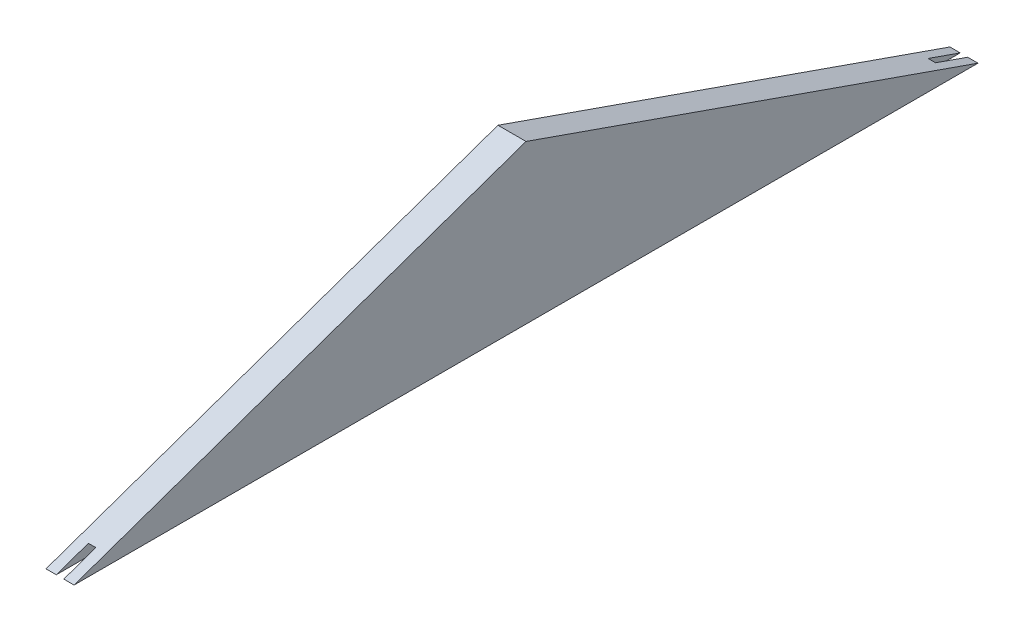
ISO-10303-21;
HEADER;
FILE_DESCRIPTION(('STEP AP214'),'2;1');
FILE_NAME('part.step','',(''),(''),'','','');
FILE_SCHEMA(('AUTOMOTIVE_DESIGN { 1 0 10303 214 1 1 1 1 }'));
ENDSEC;
DATA;
#1=APPLICATION_CONTEXT('core data for automotive mechanical design processes');
#2=APPLICATION_PROTOCOL_DEFINITION('international standard','automotive_design',2000,#1);
#3=PRODUCT_CONTEXT('',#1,'mechanical');
#4=PRODUCT('Part','Part','',(#3));
#5=PRODUCT_RELATED_PRODUCT_CATEGORY('part','',(#4));
#6=PRODUCT_DEFINITION_FORMATION('','',#4);
#7=PRODUCT_DEFINITION_CONTEXT('part definition',#1,'design');
#8=PRODUCT_DEFINITION('design','',#6,#7);
#9=PRODUCT_DEFINITION_SHAPE('','',#8);
#10=(LENGTH_UNIT() NAMED_UNIT(*) SI_UNIT(.MILLI.,.METRE.));
#11=(NAMED_UNIT(*) PLANE_ANGLE_UNIT() SI_UNIT($,.RADIAN.));
#12=(NAMED_UNIT(*) SI_UNIT($,.STERADIAN.) SOLID_ANGLE_UNIT());
#13=UNCERTAINTY_MEASURE_WITH_UNIT(LENGTH_MEASURE(1.E-05),#10,'distance_accuracy_value','');
#14=(GEOMETRIC_REPRESENTATION_CONTEXT(3) GLOBAL_UNCERTAINTY_ASSIGNED_CONTEXT((#13)) GLOBAL_UNIT_ASSIGNED_CONTEXT((#10,
#11,#12)) REPRESENTATION_CONTEXT('',''));
#15=CARTESIAN_POINT('',(0.,0.,0.));
#16=DIRECTION('',(0.,0.,1.));
#17=DIRECTION('',(1.,0.,0.));
#18=AXIS2_PLACEMENT_3D('',#15,#16,#17);
#19=CARTESIAN_POINT('',(-1.99999999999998,0.,482.9));
#20=DIRECTION('',(1.,0.,0.));
#21=DIRECTION('',(0.,1.,0.));
#22=AXIS2_PLACEMENT_3D('',#19,#20,#21);
#23=PLANE('',#22);
#24=DIRECTION('',(0.,0.330349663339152,-0.943858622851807));
#25=VECTOR('',#24,1.);
#26=CARTESIAN_POINT('',(-1.99999999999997,-38.7528058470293,469.336553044));
#27=LINE('',#26,#25);
#28=CARTESIAN_POINT('',(-1.99999999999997,-43.5,482.9));
#29=VERTEX_POINT('',#28);
#30=CARTESIAN_POINT('',(-1.99999999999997,-37.5,465.757098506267));
#31=VERTEX_POINT('',#30);
#32=EDGE_CURVE('E91',#29,#31,#27,.T.);
#33=ORIENTED_EDGE('',*,*,#32,.F.);
#34=DIRECTION('',(0.,0.,-1.));
#35=VECTOR('',#34,1.);
#36=CARTESIAN_POINT('',(-1.99999999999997,-43.5,482.9));
#37=LINE('',#36,#35);
#38=CARTESIAN_POINT('',(-1.99999999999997,-43.5,0.));
#39=VERTEX_POINT('',#38);
#40=EDGE_CURVE('E76',#29,#39,#37,.T.);
#41=ORIENTED_EDGE('',*,*,#40,.T.);
#42=DIRECTION('',(0.,0.330349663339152,0.943858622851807));
#43=VECTOR('',#42,1.);
#44=CARTESIAN_POINT('',(-1.99999999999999,111.817045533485,443.764135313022));
#45=LINE('',#44,#43);
#46=CARTESIAN_POINT('',(-1.99999999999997,-37.5,17.1429014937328));
#47=VERTEX_POINT('',#46);
#48=EDGE_CURVE('E83',#39,#47,#45,.T.);
#49=ORIENTED_EDGE('',*,*,#48,.T.);
#50=DIRECTION('',(0.,0.,-1.));
#51=VECTOR('',#50,1.);
#52=CARTESIAN_POINT('',(-1.99999999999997,-37.5,482.9));
#53=LINE('',#52,#51);
#54=EDGE_CURVE('E159',#31,#47,#53,.T.);
#55=ORIENTED_EDGE('',*,*,#54,.F.);
#56=EDGE_LOOP('',(#33,#41,#49,#55));
#57=FACE_BOUND('',#56,.T.);
#58=ADVANCED_FACE('F68',(#57),#23,.T.);
#59=CARTESIAN_POINT('',(0.,-37.5,482.9));
#60=DIRECTION('',(0.,1.,0.));
#61=DIRECTION('',(0.,0.,1.));
#62=AXIS2_PLACEMENT_3D('',#59,#60,#61);
#63=PLANE('',#62);
#64=DIRECTION('',(0.,0.,-1.));
#65=VECTOR('',#64,1.);
#66=CARTESIAN_POINT('',(2.,-37.5,482.9));
#67=LINE('',#66,#65);
#68=CARTESIAN_POINT('',(2.,-37.5,465.757098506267));
#69=VERTEX_POINT('',#68);
#70=CARTESIAN_POINT('',(2.,-37.5,17.1429014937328));
#71=VERTEX_POINT('',#70);
#72=EDGE_CURVE('E152',#69,#71,#67,.T.);
#73=ORIENTED_EDGE('',*,*,#72,.F.);
#74=DIRECTION('',(-1.,0.,0.));
#75=VECTOR('',#74,1.);
#76=CARTESIAN_POINT('',(0.,-37.5,465.757098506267));
#77=LINE('',#76,#75);
#78=EDGE_CURVE('E171',#69,#31,#77,.T.);
#79=ORIENTED_EDGE('',*,*,#78,.T.);
#80=ORIENTED_EDGE('',*,*,#54,.T.);
#81=DIRECTION('',(-1.,0.,0.));
#82=VECTOR('',#81,1.);
#83=CARTESIAN_POINT('',(0.,-37.5,17.1429014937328));
#84=LINE('',#83,#82);
#85=EDGE_CURVE('E185',#71,#47,#84,.T.);
#86=ORIENTED_EDGE('',*,*,#85,.F.);
#87=EDGE_LOOP('',(#73,#79,#80,#86));
#88=FACE_BOUND('',#87,.T.);
#89=ADVANCED_FACE('F193',(#88),#63,.F.);
#90=CARTESIAN_POINT('',(2.,0.,482.9));
#91=DIRECTION('',(1.,0.,0.));
#92=DIRECTION('',(0.,1.,0.));
#93=AXIS2_PLACEMENT_3D('',#90,#91,#92);
#94=PLANE('',#93);
#95=DIRECTION('',(0.,0.,-1.));
#96=VECTOR('',#95,1.);
#97=CARTESIAN_POINT('',(2.00000000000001,-43.5,482.9));
#98=LINE('',#97,#96);
#99=CARTESIAN_POINT('',(2.00000000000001,-43.5,482.9));
#100=VERTEX_POINT('',#99);
#101=CARTESIAN_POINT('',(2.00000000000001,-43.5,0.));
#102=VERTEX_POINT('',#101);
#103=EDGE_CURVE('E150',#100,#102,#98,.T.);
#104=ORIENTED_EDGE('',*,*,#103,.F.);
#105=DIRECTION('',(0.,0.330349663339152,-0.943858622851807));
#106=VECTOR('',#105,1.);
#107=CARTESIAN_POINT('',(2.,-38.7528058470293,469.336553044));
#108=LINE('',#107,#106);
#109=EDGE_CURVE('E132',#100,#69,#108,.T.);
#110=ORIENTED_EDGE('',*,*,#109,.T.);
#111=ORIENTED_EDGE('',*,*,#72,.T.);
#112=DIRECTION('',(0.,0.330349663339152,0.943858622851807));
#113=VECTOR('',#112,1.);
#114=CARTESIAN_POINT('',(1.99999999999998,111.817045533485,443.764135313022));
#115=LINE('',#114,#113);
#116=EDGE_CURVE('E183',#102,#71,#115,.T.);
#117=ORIENTED_EDGE('',*,*,#116,.F.);
#118=EDGE_LOOP('',(#104,#110,#111,#117));
#119=FACE_BOUND('',#118,.T.);
#120=ADVANCED_FACE('F189',(#119),#94,.F.);
#121=CARTESIAN_POINT('',(-7.5,0.,482.9));
#122=DIRECTION('',(1.,0.,0.));
#123=DIRECTION('',(0.,1.,0.));
#124=AXIS2_PLACEMENT_3D('',#121,#122,#123);
#125=PLANE('',#124);
#126=DIRECTION('',(0.,0.,-1.));
#127=VECTOR('',#126,1.);
#128=CARTESIAN_POINT('',(-7.49999999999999,-43.5,482.9));
#129=LINE('',#128,#127);
#130=CARTESIAN_POINT('',(-7.50000000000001,-43.5,482.9));
#131=VERTEX_POINT('',#130);
#132=CARTESIAN_POINT('',(-7.50000000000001,-43.5,0.));
#133=VERTEX_POINT('',#132);
#134=EDGE_CURVE('E12',#131,#133,#129,.T.);
#135=ORIENTED_EDGE('',*,*,#134,.F.);
#136=DIRECTION('',(0.,0.330349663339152,-0.943858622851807));
#137=VECTOR('',#136,1.);
#138=CARTESIAN_POINT('',(-7.50000000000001,-43.5,482.9));
#139=LINE('',#138,#137);
#140=CARTESIAN_POINT('',(-7.50000000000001,41.0072813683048,241.45));
#141=VERTEX_POINT('',#140);
#142=EDGE_CURVE('E145',#131,#141,#139,.T.);
#143=ORIENTED_EDGE('',*,*,#142,.T.);
#144=DIRECTION('',(0.,0.330349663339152,0.943858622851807));
#145=VECTOR('',#144,1.);
#146=CARTESIAN_POINT('',(-7.50000000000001,-43.5,0.));
#147=LINE('',#146,#145);
#148=EDGE_CURVE('E146',#133,#141,#147,.T.);
#149=ORIENTED_EDGE('',*,*,#148,.F.);
#150=EDGE_LOOP('',(#135,#143,#149));
#151=FACE_BOUND('',#150,.T.);
#152=ADVANCED_FACE('F70',(#151),#125,.F.);
#153=CARTESIAN_POINT('',(0.,-43.5,482.9));
#154=DIRECTION('',(0.,1.,0.));
#155=DIRECTION('',(0.,0.,1.));
#156=AXIS2_PLACEMENT_3D('',#153,#154,#155);
#157=PLANE('',#156);
#158=DIRECTION('',(1.,0.,0.));
#159=VECTOR('',#158,1.);
#160=CARTESIAN_POINT('',(0.,-43.5,0.));
#161=LINE('',#160,#159);
#162=EDGE_CURVE('E155',#133,#39,#161,.T.);
#163=ORIENTED_EDGE('',*,*,#162,.T.);
#164=ORIENTED_EDGE('',*,*,#40,.F.);
#165=DIRECTION('',(1.,0.,0.));
#166=VECTOR('',#165,1.);
#167=CARTESIAN_POINT('',(0.,-43.5,482.9));
#168=LINE('',#167,#166);
#169=EDGE_CURVE('E138',#131,#29,#168,.T.);
#170=ORIENTED_EDGE('',*,*,#169,.F.);
#171=ORIENTED_EDGE('',*,*,#134,.T.);
#172=EDGE_LOOP('',(#163,#164,#170,#171));
#173=FACE_BOUND('',#172,.T.);
#174=ADVANCED_FACE('F167',(#173),#157,.F.);
#175=CARTESIAN_POINT('',(7.50000000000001,-43.5,0.));
#176=VERTEX_POINT('',#175);
#177=EDGE_CURVE('E149',#102,#176,#161,.T.);
#178=ORIENTED_EDGE('',*,*,#177,.T.);
#179=DIRECTION('',(0.,0.,-1.));
#180=VECTOR('',#179,1.);
#181=CARTESIAN_POINT('',(7.50000000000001,-43.5,482.9));
#182=LINE('',#181,#180);
#183=CARTESIAN_POINT('',(7.50000000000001,-43.5,482.9));
#184=VERTEX_POINT('',#183);
#185=EDGE_CURVE('E137',#184,#176,#182,.T.);
#186=ORIENTED_EDGE('',*,*,#185,.F.);
#187=EDGE_CURVE('E126',#100,#184,#168,.T.);
#188=ORIENTED_EDGE('',*,*,#187,.F.);
#189=ORIENTED_EDGE('',*,*,#103,.T.);
#190=EDGE_LOOP('',(#178,#186,#188,#189));
#191=FACE_BOUND('',#190,.T.);
#192=ADVANCED_FACE('F148',(#191),#157,.F.);
#193=CARTESIAN_POINT('',(7.5,0.,482.9));
#194=DIRECTION('',(1.,0.,0.));
#195=DIRECTION('',(0.,1.,0.));
#196=AXIS2_PLACEMENT_3D('',#193,#194,#195);
#197=PLANE('',#196);
#198=DIRECTION('',(0.,0.330349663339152,-0.943858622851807));
#199=VECTOR('',#198,1.);
#200=CARTESIAN_POINT('',(7.50000000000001,-43.5,482.9));
#201=LINE('',#200,#199);
#202=CARTESIAN_POINT('',(7.50000000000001,41.0072813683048,241.45));
#203=VERTEX_POINT('',#202);
#204=EDGE_CURVE('E129',#184,#203,#201,.T.);
#205=ORIENTED_EDGE('',*,*,#204,.F.);
#206=ORIENTED_EDGE('',*,*,#185,.T.);
#207=DIRECTION('',(0.,0.330349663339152,0.943858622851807));
#208=VECTOR('',#207,1.);
#209=CARTESIAN_POINT('',(7.50000000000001,-43.5,0.));
#210=LINE('',#209,#208);
#211=EDGE_CURVE('E144',#176,#203,#210,.T.);
#212=ORIENTED_EDGE('',*,*,#211,.T.);
#213=EDGE_LOOP('',(#205,#206,#212));
#214=FACE_BOUND('',#213,.T.);
#215=ADVANCED_FACE('F142',(#214),#197,.T.);
#216=CARTESIAN_POINT('',(-7.50000000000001,-43.5,482.9));
#217=DIRECTION('',(0.,-0.943858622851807,-0.330349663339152));
#218=DIRECTION('',(0.,0.330349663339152,-0.943858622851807));
#219=AXIS2_PLACEMENT_3D('',#216,#217,#218);
#220=PLANE('',#219);
#221=ORIENTED_EDGE('',*,*,#32,.T.);
#222=ORIENTED_EDGE('',*,*,#78,.F.);
#223=ORIENTED_EDGE('',*,*,#109,.F.);
#224=ORIENTED_EDGE('',*,*,#187,.T.);
#225=ORIENTED_EDGE('',*,*,#204,.T.);
#226=DIRECTION('',(1.,0.,0.));
#227=VECTOR('',#226,1.);
#228=CARTESIAN_POINT('',(-7.50000000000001,41.0072813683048,241.45));
#229=LINE('',#228,#227);
#230=EDGE_CURVE('E176',#141,#203,#229,.T.);
#231=ORIENTED_EDGE('',*,*,#230,.F.);
#232=ORIENTED_EDGE('',*,*,#142,.F.);
#233=ORIENTED_EDGE('',*,*,#169,.T.);
#234=EDGE_LOOP('',(#221,#222,#223,#224,#225,#231,#232,#233));
#235=FACE_BOUND('',#234,.T.);
#236=ADVANCED_FACE('F128',(#235),#220,.F.);
#237=CARTESIAN_POINT('',(-7.50000000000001,-43.5,0.));
#238=DIRECTION('',(0.,0.943858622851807,-0.330349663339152));
#239=DIRECTION('',(0.,0.330349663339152,0.943858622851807));
#240=AXIS2_PLACEMENT_3D('',#237,#238,#239);
#241=PLANE('',#240);
#242=ORIENTED_EDGE('',*,*,#162,.F.);
#243=ORIENTED_EDGE('',*,*,#148,.T.);
#244=ORIENTED_EDGE('',*,*,#230,.T.);
#245=ORIENTED_EDGE('',*,*,#211,.F.);
#246=ORIENTED_EDGE('',*,*,#177,.F.);
#247=ORIENTED_EDGE('',*,*,#116,.T.);
#248=ORIENTED_EDGE('',*,*,#85,.T.);
#249=ORIENTED_EDGE('',*,*,#48,.F.);
#250=EDGE_LOOP('',(#242,#243,#244,#245,#246,#247,#248,#249));
#251=FACE_BOUND('',#250,.T.);
#252=ADVANCED_FACE('F194',(#251),#241,.T.);
#253=CLOSED_SHELL('',(#58,#89,#120,#152,#174,#192,#215,#236,#252));
#254=MANIFOLD_SOLID_BREP('B2',#253);
#255=ADVANCED_BREP_SHAPE_REPRESENTATION('',(#18,#254),#14);
#256=SHAPE_DEFINITION_REPRESENTATION(#9,#255);
ENDSEC;
END-ISO-10303-21;
